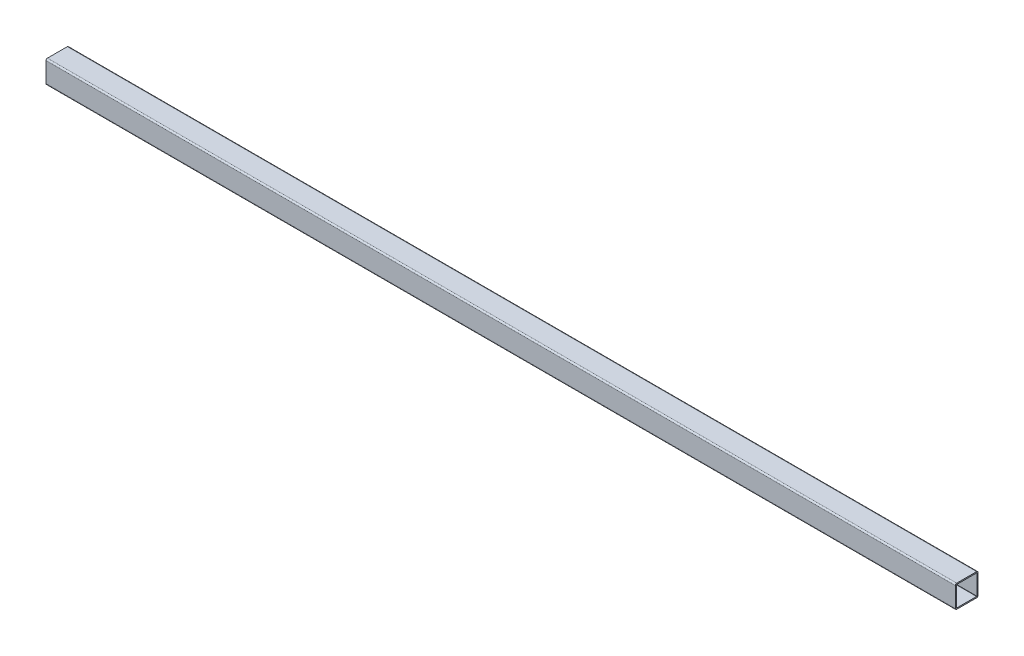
ISO-10303-21;
HEADER;
FILE_DESCRIPTION(('STEP AP214'),'2;1');
FILE_NAME('part.step','',(''),(''),'','','');
FILE_SCHEMA(('AUTOMOTIVE_DESIGN { 1 0 10303 214 1 1 1 1 }'));
ENDSEC;
DATA;
#1=APPLICATION_CONTEXT('core data for automotive mechanical design processes');
#2=APPLICATION_PROTOCOL_DEFINITION('international standard','automotive_design',2000,#1);
#3=PRODUCT_CONTEXT('',#1,'mechanical');
#4=PRODUCT('Part','Part','',(#3));
#5=PRODUCT_RELATED_PRODUCT_CATEGORY('part','',(#4));
#6=PRODUCT_DEFINITION_FORMATION('','',#4);
#7=PRODUCT_DEFINITION_CONTEXT('part definition',#1,'design');
#8=PRODUCT_DEFINITION('design','',#6,#7);
#9=PRODUCT_DEFINITION_SHAPE('','',#8);
#10=(LENGTH_UNIT() NAMED_UNIT(*) SI_UNIT(.MILLI.,.METRE.));
#11=(NAMED_UNIT(*) PLANE_ANGLE_UNIT() SI_UNIT($,.RADIAN.));
#12=(NAMED_UNIT(*) SI_UNIT($,.STERADIAN.) SOLID_ANGLE_UNIT());
#13=UNCERTAINTY_MEASURE_WITH_UNIT(LENGTH_MEASURE(1.E-05),#10,'distance_accuracy_value','');
#14=(GEOMETRIC_REPRESENTATION_CONTEXT(3) GLOBAL_UNCERTAINTY_ASSIGNED_CONTEXT((#13)) GLOBAL_UNIT_ASSIGNED_CONTEXT((#10,
#11,#12)) REPRESENTATION_CONTEXT('',''));
#15=CARTESIAN_POINT('',(0.,0.,0.));
#16=DIRECTION('',(0.,0.,1.));
#17=DIRECTION('',(1.,0.,0.));
#18=AXIS2_PLACEMENT_3D('',#15,#16,#17);
#19=CARTESIAN_POINT('',(1016.,3.65674086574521,-16.8519621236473));
#20=DIRECTION('',(-1.,0.,0.));
#21=DIRECTION('',(0.,0.,1.));
#22=AXIS2_PLACEMENT_3D('',#19,#20,#21);
#23=PLANE('',#22);
#24=CARTESIAN_POINT('',(1016.,3.65674086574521,-16.8519621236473));
#25=DIRECTION('',(1.,0.,0.));
#26=DIRECTION('',(0.,0.,1.));
#27=AXIS2_PLACEMENT_3D('',#24,#25,#26);
#28=CIRCLE('',#27,1.5875);
#29=CARTESIAN_POINT('',(1016.,3.6567408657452,-18.4394621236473));
#30=VERTEX_POINT('',#29);
#31=CARTESIAN_POINT('',(1016.,5.24424086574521,-16.8519621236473));
#32=VERTEX_POINT('',#31);
#33=EDGE_CURVE('E211',#30,#32,#28,.T.);
#34=ORIENTED_EDGE('',*,*,#33,.T.);
#35=DIRECTION('',(0.,0.,1.));
#36=VECTOR('',#35,1.);
#37=CARTESIAN_POINT('',(1016.,5.24424086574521,5.37303787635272));
#38=LINE('',#37,#36);
#39=CARTESIAN_POINT('',(1016.,5.24424086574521,5.37303787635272));
#40=VERTEX_POINT('',#39);
#41=EDGE_CURVE('E214',#32,#40,#38,.T.);
#42=ORIENTED_EDGE('',*,*,#41,.T.);
#43=CARTESIAN_POINT('',(1016.,3.65674086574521,5.37303787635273));
#44=DIRECTION('',(1.,0.,0.));
#45=DIRECTION('',(0.,0.,1.));
#46=AXIS2_PLACEMENT_3D('',#43,#44,#45);
#47=CIRCLE('',#46,1.5875);
#48=CARTESIAN_POINT('',(1016.,3.6567408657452,6.96053787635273));
#49=VERTEX_POINT('',#48);
#50=EDGE_CURVE('E217',#40,#49,#47,.T.);
#51=ORIENTED_EDGE('',*,*,#50,.T.);
#52=DIRECTION('',(0.,-1.,0.));
#53=VECTOR('',#52,1.);
#54=CARTESIAN_POINT('',(1016.,3.6567408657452,6.96053787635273));
#55=LINE('',#54,#53);
#56=CARTESIAN_POINT('',(1016.,-18.5682591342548,6.96053787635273));
#57=VERTEX_POINT('',#56);
#58=EDGE_CURVE('E219',#49,#57,#55,.T.);
#59=ORIENTED_EDGE('',*,*,#58,.T.);
#60=CARTESIAN_POINT('',(1016.,-18.5682591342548,5.37303787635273));
#61=DIRECTION('',(1.,0.,0.));
#62=DIRECTION('',(0.,0.,1.));
#63=AXIS2_PLACEMENT_3D('',#60,#61,#62);
#64=CIRCLE('',#63,1.5875);
#65=CARTESIAN_POINT('',(1016.,-20.1557591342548,5.37303787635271));
#66=VERTEX_POINT('',#65);
#67=EDGE_CURVE('E221',#57,#66,#64,.T.);
#68=ORIENTED_EDGE('',*,*,#67,.T.);
#69=DIRECTION('',(0.,0.,-1.));
#70=VECTOR('',#69,1.);
#71=CARTESIAN_POINT('',(1016.,-20.1557591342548,5.37303787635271));
#72=LINE('',#71,#70);
#73=CARTESIAN_POINT('',(1016.,-20.1557591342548,-16.8519621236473));
#74=VERTEX_POINT('',#73);
#75=EDGE_CURVE('E223',#66,#74,#72,.T.);
#76=ORIENTED_EDGE('',*,*,#75,.T.);
#77=CARTESIAN_POINT('',(1016.,-18.5682591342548,-16.8519621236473));
#78=DIRECTION('',(1.,0.,0.));
#79=DIRECTION('',(0.,0.,1.));
#80=AXIS2_PLACEMENT_3D('',#77,#78,#79);
#81=CIRCLE('',#80,1.5875);
#82=CARTESIAN_POINT('',(1016.,-18.5682591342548,-18.4394621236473));
#83=VERTEX_POINT('',#82);
#84=EDGE_CURVE('E225',#74,#83,#81,.T.);
#85=ORIENTED_EDGE('',*,*,#84,.T.);
#86=DIRECTION('',(0.,1.,0.));
#87=VECTOR('',#86,1.);
#88=CARTESIAN_POINT('',(1016.,3.6567408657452,-18.4394621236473));
#89=LINE('',#88,#87);
#90=EDGE_CURVE('E227',#83,#30,#89,.T.);
#91=ORIENTED_EDGE('',*,*,#90,.T.);
#92=EDGE_LOOP('',(#34,#42,#51,#59,#68,#76,#85,#91));
#93=FACE_BOUND('',#92,.T.);
#94=CARTESIAN_POINT('',(1016.,3.65674086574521,5.37303787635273));
#95=DIRECTION('',(1.,0.,0.));
#96=DIRECTION('',(0.,0.,1.));
#97=AXIS2_PLACEMENT_3D('',#94,#95,#96);
#98=CIRCLE('',#97,0.2413);
#99=CARTESIAN_POINT('',(1016.,3.89804086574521,5.37303787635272));
#100=VERTEX_POINT('',#99);
#101=CARTESIAN_POINT('',(1016.,3.6567408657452,5.61433787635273));
#102=VERTEX_POINT('',#101);
#103=EDGE_CURVE('E146',#100,#102,#98,.T.);
#104=ORIENTED_EDGE('',*,*,#103,.F.);
#105=DIRECTION('',(0.,0.,1.));
#106=VECTOR('',#105,1.);
#107=CARTESIAN_POINT('',(1016.,3.89804086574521,5.37303787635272));
#108=LINE('',#107,#106);
#109=CARTESIAN_POINT('',(1016.,3.89804086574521,-16.8519621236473));
#110=VERTEX_POINT('',#109);
#111=EDGE_CURVE('E179',#110,#100,#108,.T.);
#112=ORIENTED_EDGE('',*,*,#111,.F.);
#113=CARTESIAN_POINT('',(1016.,3.65674086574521,-16.8519621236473));
#114=DIRECTION('',(1.,0.,0.));
#115=DIRECTION('',(0.,0.,1.));
#116=AXIS2_PLACEMENT_3D('',#113,#114,#115);
#117=CIRCLE('',#116,0.2413);
#118=CARTESIAN_POINT('',(1016.,3.65674086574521,-17.0932621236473));
#119=VERTEX_POINT('',#118);
#120=EDGE_CURVE('E177',#119,#110,#117,.T.);
#121=ORIENTED_EDGE('',*,*,#120,.F.);
#122=DIRECTION('',(0.,1.,0.));
#123=VECTOR('',#122,1.);
#124=CARTESIAN_POINT('',(1016.,3.65674086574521,-17.0932621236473));
#125=LINE('',#124,#123);
#126=CARTESIAN_POINT('',(1016.,-18.5682591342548,-17.0932621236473));
#127=VERTEX_POINT('',#126);
#128=EDGE_CURVE('E175',#127,#119,#125,.T.);
#129=ORIENTED_EDGE('',*,*,#128,.F.);
#130=CARTESIAN_POINT('',(1016.,-18.5682591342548,-16.8519621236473));
#131=DIRECTION('',(1.,0.,0.));
#132=DIRECTION('',(0.,0.,1.));
#133=AXIS2_PLACEMENT_3D('',#130,#131,#132);
#134=CIRCLE('',#133,0.241299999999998);
#135=CARTESIAN_POINT('',(1016.,-18.8095591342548,-16.8519621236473));
#136=VERTEX_POINT('',#135);
#137=EDGE_CURVE('E173',#136,#127,#134,.T.);
#138=ORIENTED_EDGE('',*,*,#137,.F.);
#139=DIRECTION('',(0.,0.,-1.));
#140=VECTOR('',#139,1.);
#141=CARTESIAN_POINT('',(1016.,-18.8095591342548,5.37303787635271));
#142=LINE('',#141,#140);
#143=CARTESIAN_POINT('',(1016.,-18.8095591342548,5.37303787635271));
#144=VERTEX_POINT('',#143);
#145=EDGE_CURVE('E169',#144,#136,#142,.T.);
#146=ORIENTED_EDGE('',*,*,#145,.F.);
#147=CARTESIAN_POINT('',(1016.,-18.5682591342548,5.37303787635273));
#148=DIRECTION('',(1.,0.,0.));
#149=DIRECTION('',(0.,0.,1.));
#150=AXIS2_PLACEMENT_3D('',#147,#148,#149);
#151=CIRCLE('',#150,0.241299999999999);
#152=CARTESIAN_POINT('',(1016.,-18.5682591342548,5.61433787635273));
#153=VERTEX_POINT('',#152);
#154=EDGE_CURVE('E167',#153,#144,#151,.T.);
#155=ORIENTED_EDGE('',*,*,#154,.F.);
#156=DIRECTION('',(0.,-1.,0.));
#157=VECTOR('',#156,1.);
#158=CARTESIAN_POINT('',(1016.,3.6567408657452,5.61433787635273));
#159=LINE('',#158,#157);
#160=EDGE_CURVE('E154',#102,#153,#159,.T.);
#161=ORIENTED_EDGE('',*,*,#160,.F.);
#162=EDGE_LOOP('',(#104,#112,#121,#129,#138,#146,#155,#161));
#163=FACE_BOUND('',#162,.T.);
#164=ADVANCED_FACE('F33',(#93,#163),#23,.F.);
#165=CARTESIAN_POINT('',(0.,3.65674086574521,-16.8519621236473));
#166=DIRECTION('',(-1.,0.,0.));
#167=DIRECTION('',(0.,0.,1.));
#168=AXIS2_PLACEMENT_3D('',#165,#166,#167);
#169=PLANE('',#168);
#170=CARTESIAN_POINT('',(0.,3.65674086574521,-16.8519621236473));
#171=DIRECTION('',(1.,0.,0.));
#172=DIRECTION('',(0.,0.,1.));
#173=AXIS2_PLACEMENT_3D('',#170,#171,#172);
#174=CIRCLE('',#173,1.5875);
#175=CARTESIAN_POINT('',(0.,3.6567408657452,-18.4394621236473));
#176=VERTEX_POINT('',#175);
#177=CARTESIAN_POINT('',(0.,5.24424086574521,-16.8519621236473));
#178=VERTEX_POINT('',#177);
#179=EDGE_CURVE('E162',#176,#178,#174,.T.);
#180=ORIENTED_EDGE('',*,*,#179,.F.);
#181=DIRECTION('',(0.,1.,0.));
#182=VECTOR('',#181,1.);
#183=CARTESIAN_POINT('',(0.,3.6567408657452,-18.4394621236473));
#184=LINE('',#183,#182);
#185=CARTESIAN_POINT('',(0.,-18.5682591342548,-18.4394621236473));
#186=VERTEX_POINT('',#185);
#187=EDGE_CURVE('E215',#186,#176,#184,.T.);
#188=ORIENTED_EDGE('',*,*,#187,.F.);
#189=CARTESIAN_POINT('',(0.,-18.5682591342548,-16.8519621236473));
#190=DIRECTION('',(1.,0.,0.));
#191=DIRECTION('',(0.,0.,1.));
#192=AXIS2_PLACEMENT_3D('',#189,#190,#191);
#193=CIRCLE('',#192,1.5875);
#194=CARTESIAN_POINT('',(0.,-20.1557591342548,-16.8519621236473));
#195=VERTEX_POINT('',#194);
#196=EDGE_CURVE('E242',#195,#186,#193,.T.);
#197=ORIENTED_EDGE('',*,*,#196,.F.);
#198=DIRECTION('',(0.,0.,-1.));
#199=VECTOR('',#198,1.);
#200=CARTESIAN_POINT('',(0.,-20.1557591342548,5.37303787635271));
#201=LINE('',#200,#199);
#202=CARTESIAN_POINT('',(0.,-20.1557591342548,5.37303787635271));
#203=VERTEX_POINT('',#202);
#204=EDGE_CURVE('E240',#203,#195,#201,.T.);
#205=ORIENTED_EDGE('',*,*,#204,.F.);
#206=CARTESIAN_POINT('',(0.,-18.5682591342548,5.37303787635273));
#207=DIRECTION('',(1.,0.,0.));
#208=DIRECTION('',(0.,0.,1.));
#209=AXIS2_PLACEMENT_3D('',#206,#207,#208);
#210=CIRCLE('',#209,1.5875);
#211=CARTESIAN_POINT('',(0.,-18.5682591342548,6.96053787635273));
#212=VERTEX_POINT('',#211);
#213=EDGE_CURVE('E238',#212,#203,#210,.T.);
#214=ORIENTED_EDGE('',*,*,#213,.F.);
#215=DIRECTION('',(0.,-1.,0.));
#216=VECTOR('',#215,1.);
#217=CARTESIAN_POINT('',(0.,3.6567408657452,6.96053787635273));
#218=LINE('',#217,#216);
#219=CARTESIAN_POINT('',(0.,3.6567408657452,6.96053787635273));
#220=VERTEX_POINT('',#219);
#221=EDGE_CURVE('E236',#220,#212,#218,.T.);
#222=ORIENTED_EDGE('',*,*,#221,.F.);
#223=CARTESIAN_POINT('',(0.,3.65674086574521,5.37303787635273));
#224=DIRECTION('',(1.,0.,0.));
#225=DIRECTION('',(0.,0.,1.));
#226=AXIS2_PLACEMENT_3D('',#223,#224,#225);
#227=CIRCLE('',#226,1.5875);
#228=CARTESIAN_POINT('',(0.,5.24424086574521,5.37303787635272));
#229=VERTEX_POINT('',#228);
#230=EDGE_CURVE('E234',#229,#220,#227,.T.);
#231=ORIENTED_EDGE('',*,*,#230,.F.);
#232=DIRECTION('',(0.,0.,1.));
#233=VECTOR('',#232,1.);
#234=CARTESIAN_POINT('',(0.,5.24424086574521,5.37303787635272));
#235=LINE('',#234,#233);
#236=EDGE_CURVE('E232',#178,#229,#235,.T.);
#237=ORIENTED_EDGE('',*,*,#236,.F.);
#238=EDGE_LOOP('',(#180,#188,#197,#205,#214,#222,#231,#237));
#239=FACE_BOUND('',#238,.T.);
#240=DIRECTION('',(0.,0.,1.));
#241=VECTOR('',#240,1.);
#242=CARTESIAN_POINT('',(0.,3.89804086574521,5.37303787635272));
#243=LINE('',#242,#241);
#244=CARTESIAN_POINT('',(0.,3.89804086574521,-16.8519621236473));
#245=VERTEX_POINT('',#244);
#246=CARTESIAN_POINT('',(0.,3.89804086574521,5.37303787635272));
#247=VERTEX_POINT('',#246);
#248=EDGE_CURVE('E155',#245,#247,#243,.T.);
#249=ORIENTED_EDGE('',*,*,#248,.T.);
#250=CARTESIAN_POINT('',(0.,3.65674086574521,5.37303787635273));
#251=DIRECTION('',(1.,0.,0.));
#252=DIRECTION('',(0.,0.,1.));
#253=AXIS2_PLACEMENT_3D('',#250,#251,#252);
#254=CIRCLE('',#253,0.2413);
#255=CARTESIAN_POINT('',(0.,3.6567408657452,5.61433787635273));
#256=VERTEX_POINT('',#255);
#257=EDGE_CURVE('E56',#247,#256,#254,.T.);
#258=ORIENTED_EDGE('',*,*,#257,.T.);
#259=DIRECTION('',(0.,-1.,0.));
#260=VECTOR('',#259,1.);
#261=CARTESIAN_POINT('',(0.,3.6567408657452,5.61433787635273));
#262=LINE('',#261,#260);
#263=CARTESIAN_POINT('',(0.,-18.5682591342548,5.61433787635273));
#264=VERTEX_POINT('',#263);
#265=EDGE_CURVE('E161',#256,#264,#262,.T.);
#266=ORIENTED_EDGE('',*,*,#265,.T.);
#267=CARTESIAN_POINT('',(0.,-18.5682591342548,5.37303787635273));
#268=DIRECTION('',(1.,0.,0.));
#269=DIRECTION('',(0.,0.,1.));
#270=AXIS2_PLACEMENT_3D('',#267,#268,#269);
#271=CIRCLE('',#270,0.241299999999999);
#272=CARTESIAN_POINT('',(0.,-18.8095591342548,5.37303787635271));
#273=VERTEX_POINT('',#272);
#274=EDGE_CURVE('E183',#264,#273,#271,.T.);
#275=ORIENTED_EDGE('',*,*,#274,.T.);
#276=DIRECTION('',(0.,0.,-1.));
#277=VECTOR('',#276,1.);
#278=CARTESIAN_POINT('',(0.,-18.8095591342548,5.37303787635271));
#279=LINE('',#278,#277);
#280=CARTESIAN_POINT('',(0.,-18.8095591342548,-16.8519621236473));
#281=VERTEX_POINT('',#280);
#282=EDGE_CURVE('E186',#273,#281,#279,.T.);
#283=ORIENTED_EDGE('',*,*,#282,.T.);
#284=CARTESIAN_POINT('',(0.,-18.5682591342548,-16.8519621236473));
#285=DIRECTION('',(1.,0.,0.));
#286=DIRECTION('',(0.,0.,1.));
#287=AXIS2_PLACEMENT_3D('',#284,#285,#286);
#288=CIRCLE('',#287,0.241299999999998);
#289=CARTESIAN_POINT('',(0.,-18.5682591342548,-17.0932621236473));
#290=VERTEX_POINT('',#289);
#291=EDGE_CURVE('E189',#281,#290,#288,.T.);
#292=ORIENTED_EDGE('',*,*,#291,.T.);
#293=DIRECTION('',(0.,1.,0.));
#294=VECTOR('',#293,1.);
#295=CARTESIAN_POINT('',(0.,3.65674086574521,-17.0932621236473));
#296=LINE('',#295,#294);
#297=CARTESIAN_POINT('',(0.,3.65674086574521,-17.0932621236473));
#298=VERTEX_POINT('',#297);
#299=EDGE_CURVE('E192',#290,#298,#296,.T.);
#300=ORIENTED_EDGE('',*,*,#299,.T.);
#301=CARTESIAN_POINT('',(0.,3.65674086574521,-16.8519621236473));
#302=DIRECTION('',(1.,0.,0.));
#303=DIRECTION('',(0.,0.,1.));
#304=AXIS2_PLACEMENT_3D('',#301,#302,#303);
#305=CIRCLE('',#304,0.2413);
#306=EDGE_CURVE('E195',#298,#245,#305,.T.);
#307=ORIENTED_EDGE('',*,*,#306,.T.);
#308=EDGE_LOOP('',(#249,#258,#266,#275,#283,#292,#300,#307));
#309=FACE_BOUND('',#308,.T.);
#310=ADVANCED_FACE('F272',(#239,#309),#169,.T.);
#311=CARTESIAN_POINT('',(1016.,3.65674086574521,-16.8519621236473));
#312=DIRECTION('',(-1.,0.,0.));
#313=DIRECTION('',(0.,0.,1.));
#314=AXIS2_PLACEMENT_3D('',#311,#312,#313);
#315=CYLINDRICAL_SURFACE('',#314,1.5875);
#316=ORIENTED_EDGE('',*,*,#179,.T.);
#317=DIRECTION('',(-1.,0.,0.));
#318=VECTOR('',#317,1.);
#319=CARTESIAN_POINT('',(1016.,5.24424086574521,-16.8519621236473));
#320=LINE('',#319,#318);
#321=EDGE_CURVE('E11',#32,#178,#320,.T.);
#322=ORIENTED_EDGE('',*,*,#321,.F.);
#323=ORIENTED_EDGE('',*,*,#33,.F.);
#324=DIRECTION('',(-1.,0.,0.));
#325=VECTOR('',#324,1.);
#326=CARTESIAN_POINT('',(1016.,3.6567408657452,-18.4394621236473));
#327=LINE('',#326,#325);
#328=EDGE_CURVE('E229',#30,#176,#327,.T.);
#329=ORIENTED_EDGE('',*,*,#328,.T.);
#330=EDGE_LOOP('',(#316,#322,#323,#329));
#331=FACE_BOUND('',#330,.T.);
#332=ADVANCED_FACE('F35',(#331),#315,.T.);
#333=CARTESIAN_POINT('',(1016.,5.24424086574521,5.37303787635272));
#334=DIRECTION('',(0.,-1.,0.));
#335=DIRECTION('',(0.,0.,-1.));
#336=AXIS2_PLACEMENT_3D('',#333,#334,#335);
#337=PLANE('',#336);
#338=ORIENTED_EDGE('',*,*,#236,.T.);
#339=DIRECTION('',(-1.,0.,0.));
#340=VECTOR('',#339,1.);
#341=CARTESIAN_POINT('',(1016.,5.24424086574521,5.37303787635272));
#342=LINE('',#341,#340);
#343=EDGE_CURVE('E41',#40,#229,#342,.T.);
#344=ORIENTED_EDGE('',*,*,#343,.F.);
#345=ORIENTED_EDGE('',*,*,#41,.F.);
#346=ORIENTED_EDGE('',*,*,#321,.T.);
#347=EDGE_LOOP('',(#338,#344,#345,#346));
#348=FACE_BOUND('',#347,.T.);
#349=ADVANCED_FACE('F289',(#348),#337,.F.);
#350=CARTESIAN_POINT('',(1016.,3.65674086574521,5.37303787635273));
#351=DIRECTION('',(-1.,0.,0.));
#352=DIRECTION('',(0.,0.,1.));
#353=AXIS2_PLACEMENT_3D('',#350,#351,#352);
#354=CYLINDRICAL_SURFACE('',#353,1.5875);
#355=ORIENTED_EDGE('',*,*,#230,.T.);
#356=DIRECTION('',(-1.,0.,0.));
#357=VECTOR('',#356,1.);
#358=CARTESIAN_POINT('',(1016.,3.6567408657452,6.96053787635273));
#359=LINE('',#358,#357);
#360=EDGE_CURVE('E259',#49,#220,#359,.T.);
#361=ORIENTED_EDGE('',*,*,#360,.F.);
#362=ORIENTED_EDGE('',*,*,#50,.F.);
#363=ORIENTED_EDGE('',*,*,#343,.T.);
#364=EDGE_LOOP('',(#355,#361,#362,#363));
#365=FACE_BOUND('',#364,.T.);
#366=ADVANCED_FACE('F266',(#365),#354,.T.);
#367=CARTESIAN_POINT('',(1016.,3.6567408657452,6.96053787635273));
#368=DIRECTION('',(0.,0.,-1.));
#369=DIRECTION('',(0.,1.,0.));
#370=AXIS2_PLACEMENT_3D('',#367,#368,#369);
#371=PLANE('',#370);
#372=ORIENTED_EDGE('',*,*,#221,.T.);
#373=DIRECTION('',(-1.,0.,0.));
#374=VECTOR('',#373,1.);
#375=CARTESIAN_POINT('',(1016.,-18.5682591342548,6.96053787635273));
#376=LINE('',#375,#374);
#377=EDGE_CURVE('E256',#57,#212,#376,.T.);
#378=ORIENTED_EDGE('',*,*,#377,.F.);
#379=ORIENTED_EDGE('',*,*,#58,.F.);
#380=ORIENTED_EDGE('',*,*,#360,.T.);
#381=EDGE_LOOP('',(#372,#378,#379,#380));
#382=FACE_BOUND('',#381,.T.);
#383=ADVANCED_FACE('F278',(#382),#371,.F.);
#384=CARTESIAN_POINT('',(1016.,-18.5682591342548,5.37303787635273));
#385=DIRECTION('',(-1.,0.,0.));
#386=DIRECTION('',(0.,0.,1.));
#387=AXIS2_PLACEMENT_3D('',#384,#385,#386);
#388=CYLINDRICAL_SURFACE('',#387,1.5875);
#389=ORIENTED_EDGE('',*,*,#213,.T.);
#390=DIRECTION('',(-1.,0.,0.));
#391=VECTOR('',#390,1.);
#392=CARTESIAN_POINT('',(1016.,-20.1557591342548,5.37303787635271));
#393=LINE('',#392,#391);
#394=EDGE_CURVE('E253',#66,#203,#393,.T.);
#395=ORIENTED_EDGE('',*,*,#394,.F.);
#396=ORIENTED_EDGE('',*,*,#67,.F.);
#397=ORIENTED_EDGE('',*,*,#377,.T.);
#398=EDGE_LOOP('',(#389,#395,#396,#397));
#399=FACE_BOUND('',#398,.T.);
#400=ADVANCED_FACE('F282',(#399),#388,.T.);
#401=CARTESIAN_POINT('',(1016.,-20.1557591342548,5.37303787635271));
#402=DIRECTION('',(0.,1.,0.));
#403=DIRECTION('',(0.,0.,1.));
#404=AXIS2_PLACEMENT_3D('',#401,#402,#403);
#405=PLANE('',#404);
#406=ORIENTED_EDGE('',*,*,#204,.T.);
#407=DIRECTION('',(-1.,0.,0.));
#408=VECTOR('',#407,1.);
#409=CARTESIAN_POINT('',(1016.,-20.1557591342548,-16.8519621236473));
#410=LINE('',#409,#408);
#411=EDGE_CURVE('E250',#74,#195,#410,.T.);
#412=ORIENTED_EDGE('',*,*,#411,.F.);
#413=ORIENTED_EDGE('',*,*,#75,.F.);
#414=ORIENTED_EDGE('',*,*,#394,.T.);
#415=EDGE_LOOP('',(#406,#412,#413,#414));
#416=FACE_BOUND('',#415,.T.);
#417=ADVANCED_FACE('F302',(#416),#405,.F.);
#418=CARTESIAN_POINT('',(1016.,-18.5682591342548,-16.8519621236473));
#419=DIRECTION('',(-1.,0.,0.));
#420=DIRECTION('',(0.,0.,1.));
#421=AXIS2_PLACEMENT_3D('',#418,#419,#420);
#422=CYLINDRICAL_SURFACE('',#421,1.5875);
#423=ORIENTED_EDGE('',*,*,#196,.T.);
#424=DIRECTION('',(-1.,0.,0.));
#425=VECTOR('',#424,1.);
#426=CARTESIAN_POINT('',(1016.,-18.5682591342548,-18.4394621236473));
#427=LINE('',#426,#425);
#428=EDGE_CURVE('E247',#83,#186,#427,.T.);
#429=ORIENTED_EDGE('',*,*,#428,.F.);
#430=ORIENTED_EDGE('',*,*,#84,.F.);
#431=ORIENTED_EDGE('',*,*,#411,.T.);
#432=EDGE_LOOP('',(#423,#429,#430,#431));
#433=FACE_BOUND('',#432,.T.);
#434=ADVANCED_FACE('F300',(#433),#422,.T.);
#435=CARTESIAN_POINT('',(1016.,3.6567408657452,-18.4394621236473));
#436=DIRECTION('',(0.,0.,1.));
#437=DIRECTION('',(0.,-1.,0.));
#438=AXIS2_PLACEMENT_3D('',#435,#436,#437);
#439=PLANE('',#438);
#440=ORIENTED_EDGE('',*,*,#187,.T.);
#441=ORIENTED_EDGE('',*,*,#328,.F.);
#442=ORIENTED_EDGE('',*,*,#90,.F.);
#443=ORIENTED_EDGE('',*,*,#428,.T.);
#444=EDGE_LOOP('',(#440,#441,#442,#443));
#445=FACE_BOUND('',#444,.T.);
#446=ADVANCED_FACE('F295',(#445),#439,.F.);
#447=CARTESIAN_POINT('',(1016.,3.65674086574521,5.37303787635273));
#448=DIRECTION('',(-1.,0.,0.));
#449=DIRECTION('',(0.,0.,1.));
#450=AXIS2_PLACEMENT_3D('',#447,#448,#449);
#451=CYLINDRICAL_SURFACE('',#450,0.2413);
#452=ORIENTED_EDGE('',*,*,#257,.F.);
#453=DIRECTION('',(-1.,0.,0.));
#454=VECTOR('',#453,1.);
#455=CARTESIAN_POINT('',(1016.,3.89804086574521,5.37303787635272));
#456=LINE('',#455,#454);
#457=EDGE_CURVE('E150',#100,#247,#456,.T.);
#458=ORIENTED_EDGE('',*,*,#457,.F.);
#459=ORIENTED_EDGE('',*,*,#103,.T.);
#460=DIRECTION('',(-1.,0.,0.));
#461=VECTOR('',#460,1.);
#462=CARTESIAN_POINT('',(1016.,3.6567408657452,5.61433787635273));
#463=LINE('',#462,#461);
#464=EDGE_CURVE('E149',#102,#256,#463,.T.);
#465=ORIENTED_EDGE('',*,*,#464,.T.);
#466=EDGE_LOOP('',(#452,#458,#459,#465));
#467=FACE_BOUND('',#466,.T.);
#468=ADVANCED_FACE('F148',(#467),#451,.F.);
#469=CARTESIAN_POINT('',(1016.,3.6567408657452,5.61433787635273));
#470=DIRECTION('',(0.,0.,-1.));
#471=DIRECTION('',(0.,1.,0.));
#472=AXIS2_PLACEMENT_3D('',#469,#470,#471);
#473=PLANE('',#472);
#474=ORIENTED_EDGE('',*,*,#265,.F.);
#475=ORIENTED_EDGE('',*,*,#464,.F.);
#476=ORIENTED_EDGE('',*,*,#160,.T.);
#477=DIRECTION('',(-1.,0.,0.));
#478=VECTOR('',#477,1.);
#479=CARTESIAN_POINT('',(1016.,-18.5682591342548,5.61433787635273));
#480=LINE('',#479,#478);
#481=EDGE_CURVE('E163',#153,#264,#480,.T.);
#482=ORIENTED_EDGE('',*,*,#481,.T.);
#483=EDGE_LOOP('',(#474,#475,#476,#482));
#484=FACE_BOUND('',#483,.T.);
#485=ADVANCED_FACE('F158',(#484),#473,.T.);
#486=CARTESIAN_POINT('',(1016.,-18.5682591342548,5.37303787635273));
#487=DIRECTION('',(-1.,0.,0.));
#488=DIRECTION('',(0.,0.,1.));
#489=AXIS2_PLACEMENT_3D('',#486,#487,#488);
#490=CYLINDRICAL_SURFACE('',#489,0.241299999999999);
#491=ORIENTED_EDGE('',*,*,#274,.F.);
#492=ORIENTED_EDGE('',*,*,#481,.F.);
#493=ORIENTED_EDGE('',*,*,#154,.T.);
#494=DIRECTION('',(-1.,0.,0.));
#495=VECTOR('',#494,1.);
#496=CARTESIAN_POINT('',(1016.,-18.8095591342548,5.37303787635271));
#497=LINE('',#496,#495);
#498=EDGE_CURVE('E208',#144,#273,#497,.T.);
#499=ORIENTED_EDGE('',*,*,#498,.T.);
#500=EDGE_LOOP('',(#491,#492,#493,#499));
#501=FACE_BOUND('',#500,.T.);
#502=ADVANCED_FACE('F327',(#501),#490,.F.);
#503=CARTESIAN_POINT('',(1016.,-18.8095591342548,5.37303787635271));
#504=DIRECTION('',(0.,1.,0.));
#505=DIRECTION('',(0.,0.,1.));
#506=AXIS2_PLACEMENT_3D('',#503,#504,#505);
#507=PLANE('',#506);
#508=ORIENTED_EDGE('',*,*,#282,.F.);
#509=ORIENTED_EDGE('',*,*,#498,.F.);
#510=ORIENTED_EDGE('',*,*,#145,.T.);
#511=DIRECTION('',(-1.,0.,0.));
#512=VECTOR('',#511,1.);
#513=CARTESIAN_POINT('',(1016.,-18.8095591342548,-16.8519621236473));
#514=LINE('',#513,#512);
#515=EDGE_CURVE('E206',#136,#281,#514,.T.);
#516=ORIENTED_EDGE('',*,*,#515,.T.);
#517=EDGE_LOOP('',(#508,#509,#510,#516));
#518=FACE_BOUND('',#517,.T.);
#519=ADVANCED_FACE('F331',(#518),#507,.T.);
#520=CARTESIAN_POINT('',(1016.,-18.5682591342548,-16.8519621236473));
#521=DIRECTION('',(-1.,0.,0.));
#522=DIRECTION('',(0.,0.,1.));
#523=AXIS2_PLACEMENT_3D('',#520,#521,#522);
#524=CYLINDRICAL_SURFACE('',#523,0.241299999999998);
#525=ORIENTED_EDGE('',*,*,#291,.F.);
#526=ORIENTED_EDGE('',*,*,#515,.F.);
#527=ORIENTED_EDGE('',*,*,#137,.T.);
#528=DIRECTION('',(-1.,0.,0.));
#529=VECTOR('',#528,1.);
#530=CARTESIAN_POINT('',(1016.,-18.5682591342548,-17.0932621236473));
#531=LINE('',#530,#529);
#532=EDGE_CURVE('E204',#127,#290,#531,.T.);
#533=ORIENTED_EDGE('',*,*,#532,.T.);
#534=EDGE_LOOP('',(#525,#526,#527,#533));
#535=FACE_BOUND('',#534,.T.);
#536=ADVANCED_FACE('F337',(#535),#524,.F.);
#537=CARTESIAN_POINT('',(1016.,3.65674086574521,-17.0932621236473));
#538=DIRECTION('',(0.,0.,1.));
#539=DIRECTION('',(1.,0.,0.));
#540=AXIS2_PLACEMENT_3D('',#537,#538,#539);
#541=PLANE('',#540);
#542=ORIENTED_EDGE('',*,*,#299,.F.);
#543=ORIENTED_EDGE('',*,*,#532,.F.);
#544=ORIENTED_EDGE('',*,*,#128,.T.);
#545=DIRECTION('',(-1.,0.,0.));
#546=VECTOR('',#545,1.);
#547=CARTESIAN_POINT('',(1016.,3.65674086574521,-17.0932621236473));
#548=LINE('',#547,#546);
#549=EDGE_CURVE('E202',#119,#298,#548,.T.);
#550=ORIENTED_EDGE('',*,*,#549,.T.);
#551=EDGE_LOOP('',(#542,#543,#544,#550));
#552=FACE_BOUND('',#551,.T.);
#553=ADVANCED_FACE('F341',(#552),#541,.T.);
#554=CARTESIAN_POINT('',(1016.,3.65674086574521,-16.8519621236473));
#555=DIRECTION('',(-1.,0.,0.));
#556=DIRECTION('',(0.,0.,1.));
#557=AXIS2_PLACEMENT_3D('',#554,#555,#556);
#558=CYLINDRICAL_SURFACE('',#557,0.2413);
#559=ORIENTED_EDGE('',*,*,#306,.F.);
#560=ORIENTED_EDGE('',*,*,#549,.F.);
#561=ORIENTED_EDGE('',*,*,#120,.T.);
#562=DIRECTION('',(-1.,0.,0.));
#563=VECTOR('',#562,1.);
#564=CARTESIAN_POINT('',(1016.,3.89804086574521,-16.8519621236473));
#565=LINE('',#564,#563);
#566=EDGE_CURVE('E48',#110,#245,#565,.T.);
#567=ORIENTED_EDGE('',*,*,#566,.T.);
#568=EDGE_LOOP('',(#559,#560,#561,#567));
#569=FACE_BOUND('',#568,.T.);
#570=ADVANCED_FACE('F345',(#569),#558,.F.);
#571=CARTESIAN_POINT('',(1016.,3.89804086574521,5.37303787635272));
#572=DIRECTION('',(0.,-1.,0.));
#573=DIRECTION('',(0.,0.,-1.));
#574=AXIS2_PLACEMENT_3D('',#571,#572,#573);
#575=PLANE('',#574);
#576=ORIENTED_EDGE('',*,*,#248,.F.);
#577=ORIENTED_EDGE('',*,*,#566,.F.);
#578=ORIENTED_EDGE('',*,*,#111,.T.);
#579=ORIENTED_EDGE('',*,*,#457,.T.);
#580=EDGE_LOOP('',(#576,#577,#578,#579));
#581=FACE_BOUND('',#580,.T.);
#582=ADVANCED_FACE('F349',(#581),#575,.T.);
#583=CLOSED_SHELL('',(#164,#310,#332,#349,#366,#383,#400,#417,#434,#446,#468,#485,#502,#519,
#536,#553,#570,#582));
#584=MANIFOLD_SOLID_BREP('B2',#583);
#585=ADVANCED_BREP_SHAPE_REPRESENTATION('',(#18,#584),#14);
#586=SHAPE_DEFINITION_REPRESENTATION(#9,#585);
ENDSEC;
END-ISO-10303-21;
